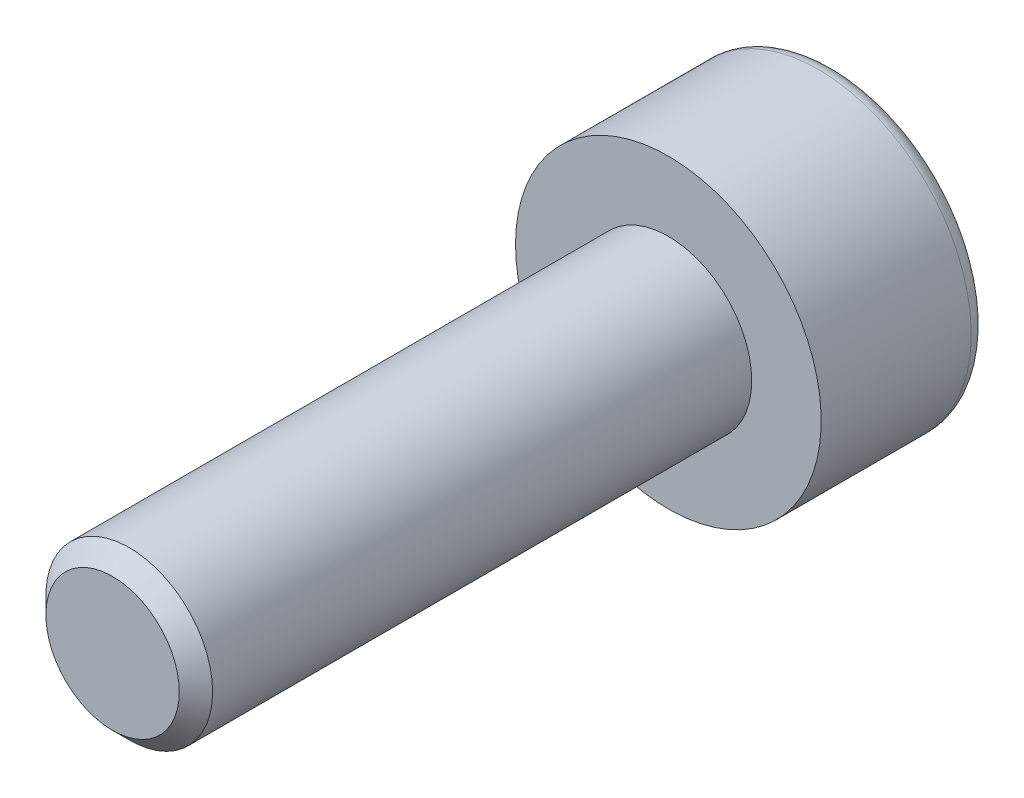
ISO-10303-21;
HEADER;
FILE_DESCRIPTION(('STEP AP214'),'2;1');
FILE_NAME('part.step','',(''),(''),'','','');
FILE_SCHEMA(('AUTOMOTIVE_DESIGN { 1 0 10303 214 1 1 1 1 }'));
ENDSEC;
DATA;
#1=APPLICATION_CONTEXT('core data for automotive mechanical design processes');
#2=APPLICATION_PROTOCOL_DEFINITION('international standard','automotive_design',2000,#1);
#3=PRODUCT_CONTEXT('',#1,'mechanical');
#4=PRODUCT('Part','Part','',(#3));
#5=PRODUCT_RELATED_PRODUCT_CATEGORY('part','',(#4));
#6=PRODUCT_DEFINITION_FORMATION('','',#4);
#7=PRODUCT_DEFINITION_CONTEXT('part definition',#1,'design');
#8=PRODUCT_DEFINITION('design','',#6,#7);
#9=PRODUCT_DEFINITION_SHAPE('','',#8);
#10=(LENGTH_UNIT() NAMED_UNIT(*) SI_UNIT(.MILLI.,.METRE.));
#11=(NAMED_UNIT(*) PLANE_ANGLE_UNIT() SI_UNIT($,.RADIAN.));
#12=(NAMED_UNIT(*) SI_UNIT($,.STERADIAN.) SOLID_ANGLE_UNIT());
#13=UNCERTAINTY_MEASURE_WITH_UNIT(LENGTH_MEASURE(1.E-05),#10,'distance_accuracy_value','');
#14=(GEOMETRIC_REPRESENTATION_CONTEXT(3) GLOBAL_UNCERTAINTY_ASSIGNED_CONTEXT((#13)) GLOBAL_UNIT_ASSIGNED_CONTEXT((#10,
#11,#12)) REPRESENTATION_CONTEXT('',''));
#15=CARTESIAN_POINT('',(0.,0.,0.));
#16=DIRECTION('',(0.,0.,1.));
#17=DIRECTION('',(1.,0.,0.));
#18=AXIS2_PLACEMENT_3D('',#15,#16,#17);
#19=CARTESIAN_POINT('',(0.,0.,-3.));
#20=DIRECTION('',(0.,0.,1.));
#21=DIRECTION('',(1.,0.,0.));
#22=AXIS2_PLACEMENT_3D('',#19,#20,#21);
#23=PLANE('',#22);
#24=CARTESIAN_POINT('',(0.,0.,-3.));
#25=DIRECTION('',(0.,0.,-1.));
#26=DIRECTION('',(-1.,0.,0.));
#27=AXIS2_PLACEMENT_3D('',#24,#25,#26);
#28=CIRCLE('',#27,2.45);
#29=CARTESIAN_POINT('',(-2.45,0.,-3.));
#30=VERTEX_POINT('',#29);
#31=EDGE_CURVE('E138',#30,#30,#28,.T.);
#32=ORIENTED_EDGE('',*,*,#31,.T.);
#33=EDGE_LOOP('',(#32));
#34=FACE_BOUND('',#33,.T.);
#35=DIRECTION('',(-0.86602540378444,0.499999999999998,0.));
#36=VECTOR('',#35,1.);
#37=CARTESIAN_POINT('',(0.,1.44337567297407,-3.));
#38=LINE('',#37,#36);
#39=CARTESIAN_POINT('',(1.25,0.721687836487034,-3.));
#40=VERTEX_POINT('',#39);
#41=CARTESIAN_POINT('',(0.,1.44337567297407,-3.));
#42=VERTEX_POINT('',#41);
#43=EDGE_CURVE('E42',#40,#42,#38,.T.);
#44=ORIENTED_EDGE('',*,*,#43,.T.);
#45=DIRECTION('',(-0.866025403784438,-0.500000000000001,0.));
#46=VECTOR('',#45,1.);
#47=CARTESIAN_POINT('',(0.,1.44337567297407,-3.));
#48=LINE('',#47,#46);
#49=CARTESIAN_POINT('',(-1.25,0.721687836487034,-3.));
#50=VERTEX_POINT('',#49);
#51=EDGE_CURVE('E82',#42,#50,#48,.T.);
#52=ORIENTED_EDGE('',*,*,#51,.T.);
#53=DIRECTION('',(0.,-1.,0.));
#54=VECTOR('',#53,1.);
#55=CARTESIAN_POINT('',(-1.25,-0.721687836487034,-3.));
#56=LINE('',#55,#54);
#57=CARTESIAN_POINT('',(-1.25,-0.721687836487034,-3.));
#58=VERTEX_POINT('',#57);
#59=EDGE_CURVE('E90',#50,#58,#56,.T.);
#60=ORIENTED_EDGE('',*,*,#59,.T.);
#61=DIRECTION('',(0.866025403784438,-0.500000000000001,0.));
#62=VECTOR('',#61,1.);
#63=CARTESIAN_POINT('',(0.,-1.44337567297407,-3.));
#64=LINE('',#63,#62);
#65=CARTESIAN_POINT('',(0.,-1.44337567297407,-3.));
#66=VERTEX_POINT('',#65);
#67=EDGE_CURVE('E108',#58,#66,#64,.T.);
#68=ORIENTED_EDGE('',*,*,#67,.T.);
#69=DIRECTION('',(0.86602540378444,0.499999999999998,0.));
#70=VECTOR('',#69,1.);
#71=CARTESIAN_POINT('',(0.,-1.44337567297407,-3.));
#72=LINE('',#71,#70);
#73=CARTESIAN_POINT('',(1.25,-0.721687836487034,-3.));
#74=VERTEX_POINT('',#73);
#75=EDGE_CURVE('E111',#66,#74,#72,.T.);
#76=ORIENTED_EDGE('',*,*,#75,.T.);
#77=DIRECTION('',(0.,1.,0.));
#78=VECTOR('',#77,1.);
#79=CARTESIAN_POINT('',(1.25,-0.721687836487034,-3.));
#80=LINE('',#79,#78);
#81=EDGE_CURVE('E101',#74,#40,#80,.T.);
#82=ORIENTED_EDGE('',*,*,#81,.T.);
#83=EDGE_LOOP('',(#44,#52,#60,#68,#76,#82));
#84=FACE_BOUND('',#83,.T.);
#85=ADVANCED_FACE('F28',(#34,#84),#23,.F.);
#86=CARTESIAN_POINT('',(0.,0.,-2.7));
#87=DIRECTION('',(0.,0.,-1.));
#88=DIRECTION('',(-1.,0.,0.));
#89=AXIS2_PLACEMENT_3D('',#86,#87,#88);
#90=TOROIDAL_SURFACE('',#89,2.45,0.299999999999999);
#91=ORIENTED_EDGE('',*,*,#31,.F.);
#92=EDGE_LOOP('',(#91));
#93=FACE_BOUND('',#92,.T.);
#94=CARTESIAN_POINT('',(0.,0.,-2.7));
#95=DIRECTION('',(0.,0.,-1.));
#96=DIRECTION('',(-1.,0.,0.));
#97=AXIS2_PLACEMENT_3D('',#94,#95,#96);
#98=CIRCLE('',#97,2.75);
#99=CARTESIAN_POINT('',(-2.75,0.,-2.7));
#100=VERTEX_POINT('',#99);
#101=EDGE_CURVE('E135',#100,#100,#98,.T.);
#102=ORIENTED_EDGE('',*,*,#101,.T.);
#103=EDGE_LOOP('',(#102));
#104=FACE_BOUND('',#103,.T.);
#105=ADVANCED_FACE('F157',(#93,#104),#90,.T.);
#106=CARTESIAN_POINT('',(0.,0.,0.));
#107=DIRECTION('',(0.,0.,-1.));
#108=DIRECTION('',(-1.,0.,0.));
#109=AXIS2_PLACEMENT_3D('',#106,#107,#108);
#110=CYLINDRICAL_SURFACE('',#109,2.75);
#111=ORIENTED_EDGE('',*,*,#101,.F.);
#112=EDGE_LOOP('',(#111));
#113=FACE_BOUND('',#112,.T.);
#114=CARTESIAN_POINT('',(0.,0.,0.));
#115=DIRECTION('',(0.,0.,-1.));
#116=DIRECTION('',(-1.,0.,0.));
#117=AXIS2_PLACEMENT_3D('',#114,#115,#116);
#118=CIRCLE('',#117,2.75);
#119=CARTESIAN_POINT('',(-2.75,0.,0.));
#120=VERTEX_POINT('',#119);
#121=EDGE_CURVE('E96',#120,#120,#118,.T.);
#122=ORIENTED_EDGE('',*,*,#121,.T.);
#123=EDGE_LOOP('',(#122));
#124=FACE_BOUND('',#123,.T.);
#125=ADVANCED_FACE('F162',(#113,#124),#110,.T.);
#126=CARTESIAN_POINT('',(0.,0.,0.));
#127=DIRECTION('',(0.,0.,-1.));
#128=DIRECTION('',(-1.,0.,0.));
#129=AXIS2_PLACEMENT_3D('',#126,#127,#128);
#130=PLANE('',#129);
#131=CARTESIAN_POINT('',(0.,0.,0.));
#132=DIRECTION('',(0.,0.,1.));
#133=DIRECTION('',(1.,0.,0.));
#134=AXIS2_PLACEMENT_3D('',#131,#132,#133);
#135=CIRCLE('',#134,1.5);
#136=CARTESIAN_POINT('',(1.5,0.,0.));
#137=VERTEX_POINT('',#136);
#138=EDGE_CURVE('E102',#137,#137,#135,.T.);
#139=ORIENTED_EDGE('',*,*,#138,.F.);
#140=EDGE_LOOP('',(#139));
#141=FACE_BOUND('',#140,.T.);
#142=ORIENTED_EDGE('',*,*,#121,.F.);
#143=EDGE_LOOP('',(#142));
#144=FACE_BOUND('',#143,.T.);
#145=ADVANCED_FACE('F170',(#141,#144),#130,.F.);
#146=CARTESIAN_POINT('',(0.,1.44337567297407,-1.7));
#147=DIRECTION('',(-0.499999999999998,-0.86602540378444,0.));
#148=DIRECTION('',(0.86602540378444,-0.499999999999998,0.));
#149=AXIS2_PLACEMENT_3D('',#146,#147,#148);
#150=PLANE('',#149);
#151=ORIENTED_EDGE('',*,*,#43,.F.);
#152=DIRECTION('',(0.,0.,-1.));
#153=VECTOR('',#152,1.);
#154=CARTESIAN_POINT('',(1.25,0.721687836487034,-1.7));
#155=LINE('',#154,#153);
#156=CARTESIAN_POINT('',(1.25,0.721687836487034,-1.7));
#157=VERTEX_POINT('',#156);
#158=EDGE_CURVE('E124',#157,#40,#155,.T.);
#159=ORIENTED_EDGE('',*,*,#158,.F.);
#160=DIRECTION('',(-0.86602540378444,0.499999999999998,0.));
#161=VECTOR('',#160,1.);
#162=CARTESIAN_POINT('',(0.,1.44337567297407,-1.7));
#163=LINE('',#162,#161);
#164=CARTESIAN_POINT('',(0.,1.44337567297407,-1.7));
#165=VERTEX_POINT('',#164);
#166=EDGE_CURVE('E95',#157,#165,#163,.T.);
#167=ORIENTED_EDGE('',*,*,#166,.T.);
#168=DIRECTION('',(0.,0.,-1.));
#169=VECTOR('',#168,1.);
#170=CARTESIAN_POINT('',(0.,1.44337567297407,-1.7));
#171=LINE('',#170,#169);
#172=EDGE_CURVE('E84',#165,#42,#171,.T.);
#173=ORIENTED_EDGE('',*,*,#172,.T.);
#174=EDGE_LOOP('',(#151,#159,#167,#173));
#175=FACE_BOUND('',#174,.T.);
#176=ADVANCED_FACE('F93',(#175),#150,.T.);
#177=CARTESIAN_POINT('',(0.,1.44337567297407,-1.7));
#178=DIRECTION('',(0.500000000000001,-0.866025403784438,0.));
#179=DIRECTION('',(0.866025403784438,0.500000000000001,0.));
#180=AXIS2_PLACEMENT_3D('',#177,#178,#179);
#181=PLANE('',#180);
#182=ORIENTED_EDGE('',*,*,#51,.F.);
#183=ORIENTED_EDGE('',*,*,#172,.F.);
#184=DIRECTION('',(-0.866025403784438,-0.500000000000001,0.));
#185=VECTOR('',#184,1.);
#186=CARTESIAN_POINT('',(0.,1.44337567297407,-1.7));
#187=LINE('',#186,#185);
#188=CARTESIAN_POINT('',(-1.25,0.721687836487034,-1.7));
#189=VERTEX_POINT('',#188);
#190=EDGE_CURVE('E115',#165,#189,#187,.T.);
#191=ORIENTED_EDGE('',*,*,#190,.T.);
#192=DIRECTION('',(0.,0.,-1.));
#193=VECTOR('',#192,1.);
#194=CARTESIAN_POINT('',(-1.25,0.721687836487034,-1.7));
#195=LINE('',#194,#193);
#196=EDGE_CURVE('E86',#189,#50,#195,.T.);
#197=ORIENTED_EDGE('',*,*,#196,.T.);
#198=EDGE_LOOP('',(#182,#183,#191,#197));
#199=FACE_BOUND('',#198,.T.);
#200=ADVANCED_FACE('F83',(#199),#181,.T.);
#201=CARTESIAN_POINT('',(-1.25,-0.721687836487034,-1.7));
#202=DIRECTION('',(1.,0.,0.));
#203=DIRECTION('',(0.,0.,-1.));
#204=AXIS2_PLACEMENT_3D('',#201,#202,#203);
#205=PLANE('',#204);
#206=ORIENTED_EDGE('',*,*,#59,.F.);
#207=ORIENTED_EDGE('',*,*,#196,.F.);
#208=DIRECTION('',(0.,-1.,0.));
#209=VECTOR('',#208,1.);
#210=CARTESIAN_POINT('',(-1.25,-0.721687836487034,-1.7));
#211=LINE('',#210,#209);
#212=CARTESIAN_POINT('',(-1.25,-0.721687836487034,-1.7));
#213=VERTEX_POINT('',#212);
#214=EDGE_CURVE('E117',#189,#213,#211,.T.);
#215=ORIENTED_EDGE('',*,*,#214,.T.);
#216=DIRECTION('',(0.,0.,-1.));
#217=VECTOR('',#216,1.);
#218=CARTESIAN_POINT('',(-1.25,-0.721687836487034,-1.7));
#219=LINE('',#218,#217);
#220=EDGE_CURVE('E130',#213,#58,#219,.T.);
#221=ORIENTED_EDGE('',*,*,#220,.T.);
#222=EDGE_LOOP('',(#206,#207,#215,#221));
#223=FACE_BOUND('',#222,.T.);
#224=ADVANCED_FACE('F185',(#223),#205,.T.);
#225=CARTESIAN_POINT('',(0.,-1.44337567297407,-1.7));
#226=DIRECTION('',(0.500000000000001,0.866025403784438,0.));
#227=DIRECTION('',(-0.866025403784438,0.500000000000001,0.));
#228=AXIS2_PLACEMENT_3D('',#225,#226,#227);
#229=PLANE('',#228);
#230=ORIENTED_EDGE('',*,*,#67,.F.);
#231=ORIENTED_EDGE('',*,*,#220,.F.);
#232=DIRECTION('',(0.866025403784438,-0.500000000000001,0.));
#233=VECTOR('',#232,1.);
#234=CARTESIAN_POINT('',(0.,-1.44337567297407,-1.7));
#235=LINE('',#234,#233);
#236=CARTESIAN_POINT('',(0.,-1.44337567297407,-1.7));
#237=VERTEX_POINT('',#236);
#238=EDGE_CURVE('E119',#213,#237,#235,.T.);
#239=ORIENTED_EDGE('',*,*,#238,.T.);
#240=DIRECTION('',(0.,0.,-1.));
#241=VECTOR('',#240,1.);
#242=CARTESIAN_POINT('',(0.,-1.44337567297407,-1.7));
#243=LINE('',#242,#241);
#244=EDGE_CURVE('E128',#237,#66,#243,.T.);
#245=ORIENTED_EDGE('',*,*,#244,.T.);
#246=EDGE_LOOP('',(#230,#231,#239,#245));
#247=FACE_BOUND('',#246,.T.);
#248=ADVANCED_FACE('F188',(#247),#229,.T.);
#249=CARTESIAN_POINT('',(0.,-1.44337567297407,-1.7));
#250=DIRECTION('',(-0.499999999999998,0.86602540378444,0.));
#251=DIRECTION('',(-0.86602540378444,-0.499999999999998,0.));
#252=AXIS2_PLACEMENT_3D('',#249,#250,#251);
#253=PLANE('',#252);
#254=ORIENTED_EDGE('',*,*,#75,.F.);
#255=ORIENTED_EDGE('',*,*,#244,.F.);
#256=DIRECTION('',(0.86602540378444,0.499999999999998,0.));
#257=VECTOR('',#256,1.);
#258=CARTESIAN_POINT('',(0.,-1.44337567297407,-1.7));
#259=LINE('',#258,#257);
#260=CARTESIAN_POINT('',(1.25,-0.721687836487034,-1.7));
#261=VERTEX_POINT('',#260);
#262=EDGE_CURVE('E121',#237,#261,#259,.T.);
#263=ORIENTED_EDGE('',*,*,#262,.T.);
#264=DIRECTION('',(0.,0.,-1.));
#265=VECTOR('',#264,1.);
#266=CARTESIAN_POINT('',(1.25,-0.721687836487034,-1.7));
#267=LINE('',#266,#265);
#268=EDGE_CURVE('E126',#261,#74,#267,.T.);
#269=ORIENTED_EDGE('',*,*,#268,.T.);
#270=EDGE_LOOP('',(#254,#255,#263,#269));
#271=FACE_BOUND('',#270,.T.);
#272=ADVANCED_FACE('F192',(#271),#253,.T.);
#273=CARTESIAN_POINT('',(1.25,-0.721687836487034,-1.7));
#274=DIRECTION('',(-1.,0.,0.));
#275=DIRECTION('',(0.,0.,1.));
#276=AXIS2_PLACEMENT_3D('',#273,#274,#275);
#277=PLANE('',#276);
#278=ORIENTED_EDGE('',*,*,#81,.F.);
#279=ORIENTED_EDGE('',*,*,#268,.F.);
#280=DIRECTION('',(0.,1.,0.));
#281=VECTOR('',#280,1.);
#282=CARTESIAN_POINT('',(1.25,-0.721687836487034,-1.7));
#283=LINE('',#282,#281);
#284=EDGE_CURVE('E49',#261,#157,#283,.T.);
#285=ORIENTED_EDGE('',*,*,#284,.T.);
#286=ORIENTED_EDGE('',*,*,#158,.T.);
#287=EDGE_LOOP('',(#278,#279,#285,#286));
#288=FACE_BOUND('',#287,.T.);
#289=ADVANCED_FACE('F196',(#288),#277,.T.);
#290=CARTESIAN_POINT('',(1.25,0.721687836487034,-1.7));
#291=DIRECTION('',(0.,0.,1.));
#292=DIRECTION('',(1.,0.,0.));
#293=AXIS2_PLACEMENT_3D('',#290,#291,#292);
#294=PLANE('',#293);
#295=ORIENTED_EDGE('',*,*,#166,.F.);
#296=ORIENTED_EDGE('',*,*,#284,.F.);
#297=ORIENTED_EDGE('',*,*,#262,.F.);
#298=ORIENTED_EDGE('',*,*,#238,.F.);
#299=ORIENTED_EDGE('',*,*,#214,.F.);
#300=ORIENTED_EDGE('',*,*,#190,.F.);
#301=EDGE_LOOP('',(#295,#296,#297,#298,#299,#300));
#302=FACE_BOUND('',#301,.T.);
#303=ADVANCED_FACE('F200',(#302),#294,.F.);
#304=CARTESIAN_POINT('',(0.,0.,10.));
#305=DIRECTION('',(0.,0.,1.));
#306=DIRECTION('',(1.,0.,0.));
#307=AXIS2_PLACEMENT_3D('',#304,#305,#306);
#308=PLANE('',#307);
#309=CARTESIAN_POINT('',(0.,0.,10.));
#310=DIRECTION('',(0.,0.,1.));
#311=DIRECTION('',(1.,0.,0.));
#312=AXIS2_PLACEMENT_3D('',#309,#310,#311);
#313=CIRCLE('',#312,1.2);
#314=CARTESIAN_POINT('',(1.2,0.,10.));
#315=VERTEX_POINT('',#314);
#316=EDGE_CURVE('E35',#315,#315,#313,.T.);
#317=ORIENTED_EDGE('',*,*,#316,.T.);
#318=EDGE_LOOP('',(#317));
#319=FACE_BOUND('',#318,.T.);
#320=ADVANCED_FACE('F143',(#319),#308,.T.);
#321=CARTESIAN_POINT('',(0.,0.,0.));
#322=DIRECTION('',(0.,0.,1.));
#323=DIRECTION('',(1.,0.,0.));
#324=AXIS2_PLACEMENT_3D('',#321,#322,#323);
#325=CYLINDRICAL_SURFACE('',#324,1.5);
#326=CARTESIAN_POINT('',(0.,0.,9.7));
#327=DIRECTION('',(0.,0.,1.));
#328=DIRECTION('',(1.,0.,0.));
#329=AXIS2_PLACEMENT_3D('',#326,#327,#328);
#330=CIRCLE('',#329,1.5);
#331=CARTESIAN_POINT('',(1.5,0.,9.7));
#332=VERTEX_POINT('',#331);
#333=EDGE_CURVE('E11',#332,#332,#330,.F.);
#334=ORIENTED_EDGE('',*,*,#333,.T.);
#335=EDGE_LOOP('',(#334));
#336=FACE_BOUND('',#335,.T.);
#337=ORIENTED_EDGE('',*,*,#138,.T.);
#338=EDGE_LOOP('',(#337));
#339=FACE_BOUND('',#338,.T.);
#340=ADVANCED_FACE('F147',(#336,#339),#325,.T.);
#341=CARTESIAN_POINT('',(0.,0.,10.));
#342=DIRECTION('',(0.,0.,-1.));
#343=DIRECTION('',(-1.,0.,0.));
#344=AXIS2_PLACEMENT_3D('',#341,#342,#343);
#345=CONICAL_SURFACE('',#344,1.2,0.785398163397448);
#346=ORIENTED_EDGE('',*,*,#333,.F.);
#347=EDGE_LOOP('',(#346));
#348=FACE_BOUND('',#347,.T.);
#349=ORIENTED_EDGE('',*,*,#316,.F.);
#350=EDGE_LOOP('',(#349));
#351=FACE_BOUND('',#350,.T.);
#352=ADVANCED_FACE('F145',(#348,#351),#345,.T.);
#353=CLOSED_SHELL('',(#85,#105,#125,#145,#176,#200,#224,#248,#272,#289,#303,#320,#340,#352));
#354=MANIFOLD_SOLID_BREP('B2',#353);
#355=ADVANCED_BREP_SHAPE_REPRESENTATION('',(#18,#354),#14);
#356=SHAPE_DEFINITION_REPRESENTATION(#9,#355);
ENDSEC;
END-ISO-10303-21;
